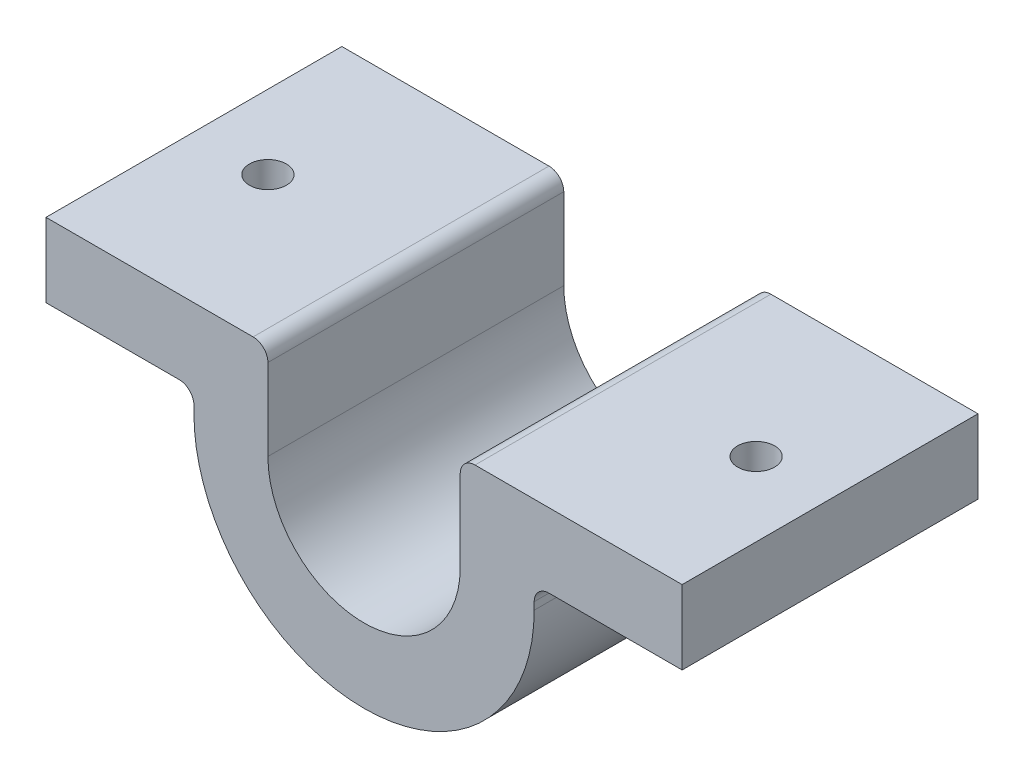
ISO-10303-21;
HEADER;
FILE_DESCRIPTION(('STEP AP214'),'2;1');
FILE_NAME('part.step','',(''),(''),'','','');
FILE_SCHEMA(('AUTOMOTIVE_DESIGN { 1 0 10303 214 1 1 1 1 }'));
ENDSEC;
DATA;
#1=APPLICATION_CONTEXT('core data for automotive mechanical design processes');
#2=APPLICATION_PROTOCOL_DEFINITION('international standard','automotive_design',2000,#1);
#3=PRODUCT_CONTEXT('',#1,'mechanical');
#4=PRODUCT('Part','Part','',(#3));
#5=PRODUCT_RELATED_PRODUCT_CATEGORY('part','',(#4));
#6=PRODUCT_DEFINITION_FORMATION('','',#4);
#7=PRODUCT_DEFINITION_CONTEXT('part definition',#1,'design');
#8=PRODUCT_DEFINITION('design','',#6,#7);
#9=PRODUCT_DEFINITION_SHAPE('','',#8);
#10=(LENGTH_UNIT() NAMED_UNIT(*) SI_UNIT(.MILLI.,.METRE.));
#11=(NAMED_UNIT(*) PLANE_ANGLE_UNIT() SI_UNIT($,.RADIAN.));
#12=(NAMED_UNIT(*) SI_UNIT($,.STERADIAN.) SOLID_ANGLE_UNIT());
#13=UNCERTAINTY_MEASURE_WITH_UNIT(LENGTH_MEASURE(1.E-05),#10,'distance_accuracy_value','');
#14=(GEOMETRIC_REPRESENTATION_CONTEXT(3) GLOBAL_UNCERTAINTY_ASSIGNED_CONTEXT((#13)) GLOBAL_UNIT_ASSIGNED_CONTEXT((#10,
#11,#12)) REPRESENTATION_CONTEXT('',''));
#15=CARTESIAN_POINT('',(0.,0.,0.));
#16=DIRECTION('',(0.,0.,1.));
#17=DIRECTION('',(1.,0.,0.));
#18=AXIS2_PLACEMENT_3D('',#15,#16,#17);
#19=CARTESIAN_POINT('',(-11.5,0.,-20.));
#20=DIRECTION('',(1.,0.,0.));
#21=DIRECTION('',(0.,0.,-1.));
#22=AXIS2_PLACEMENT_3D('',#19,#20,#21);
#23=PLANE('',#22);
#24=DIRECTION('',(0.,1.,0.));
#25=VECTOR('',#24,1.);
#26=CARTESIAN_POINT('',(-11.5,0.,0.));
#27=LINE('',#26,#25);
#28=CARTESIAN_POINT('',(-11.5,0.,0.));
#29=VERTEX_POINT('',#28);
#30=CARTESIAN_POINT('',(-11.5,0.499999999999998,0.));
#31=VERTEX_POINT('',#30);
#32=EDGE_CURVE('E196',#29,#31,#27,.T.);
#33=ORIENTED_EDGE('',*,*,#32,.T.);
#34=DIRECTION('',(0.,0.,1.));
#35=VECTOR('',#34,1.);
#36=CARTESIAN_POINT('',(-11.5,0.499999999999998,-20.));
#37=LINE('',#36,#35);
#38=CARTESIAN_POINT('',(-11.5,0.499999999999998,-20.));
#39=VERTEX_POINT('',#38);
#40=EDGE_CURVE('E165',#31,#39,#37,.F.);
#41=ORIENTED_EDGE('',*,*,#40,.T.);
#42=DIRECTION('',(0.,1.,0.));
#43=VECTOR('',#42,1.);
#44=CARTESIAN_POINT('',(-11.5,0.,-20.));
#45=LINE('',#44,#43);
#46=CARTESIAN_POINT('',(-11.5,0.,-20.));
#47=VERTEX_POINT('',#46);
#48=EDGE_CURVE('E163',#47,#39,#45,.T.);
#49=ORIENTED_EDGE('',*,*,#48,.F.);
#50=DIRECTION('',(0.,0.,1.));
#51=VECTOR('',#50,1.);
#52=CARTESIAN_POINT('',(-11.5,0.,-20.));
#53=LINE('',#52,#51);
#54=EDGE_CURVE('E149',#47,#29,#53,.T.);
#55=ORIENTED_EDGE('',*,*,#54,.T.);
#56=EDGE_LOOP('',(#33,#41,#49,#55));
#57=FACE_BOUND('',#56,.T.);
#58=ADVANCED_FACE('F35',(#57),#23,.F.);
#59=CARTESIAN_POINT('',(0.,1.5,-20.));
#60=DIRECTION('',(0.,1.,0.));
#61=DIRECTION('',(-1.,0.,0.));
#62=AXIS2_PLACEMENT_3D('',#59,#60,#61);
#63=PLANE('',#62);
#64=CARTESIAN_POINT('',(-16.5,1.5,-10.));
#65=DIRECTION('',(0.,-1.,0.));
#66=DIRECTION('',(1.,0.,0.));
#67=AXIS2_PLACEMENT_3D('',#64,#65,#66);
#68=CIRCLE('',#67,1.25);
#69=CARTESIAN_POINT('',(-15.25,1.5,-10.));
#70=VERTEX_POINT('',#69);
#71=EDGE_CURVE('E503',#70,#70,#68,.T.);
#72=ORIENTED_EDGE('',*,*,#71,.F.);
#73=EDGE_LOOP('',(#72));
#74=FACE_BOUND('',#73,.T.);
#75=DIRECTION('',(-1.,0.,0.));
#76=VECTOR('',#75,1.);
#77=CARTESIAN_POINT('',(0.,1.5,-20.));
#78=LINE('',#77,#76);
#79=CARTESIAN_POINT('',(-12.5,1.5,-20.));
#80=VERTEX_POINT('',#79);
#81=CARTESIAN_POINT('',(-21.5,1.5,-20.));
#82=VERTEX_POINT('',#81);
#83=EDGE_CURVE('E160',#80,#82,#78,.T.);
#84=ORIENTED_EDGE('',*,*,#83,.F.);
#85=DIRECTION('',(0.,0.,1.));
#86=VECTOR('',#85,1.);
#87=CARTESIAN_POINT('',(-12.5,1.5,0.));
#88=LINE('',#87,#86);
#89=CARTESIAN_POINT('',(-12.5,1.5,0.));
#90=VERTEX_POINT('',#89);
#91=EDGE_CURVE('E267',#80,#90,#88,.T.);
#92=ORIENTED_EDGE('',*,*,#91,.T.);
#93=DIRECTION('',(-1.,0.,0.));
#94=VECTOR('',#93,1.);
#95=CARTESIAN_POINT('',(0.,1.5,0.));
#96=LINE('',#95,#94);
#97=CARTESIAN_POINT('',(-21.5,1.5,0.));
#98=VERTEX_POINT('',#97);
#99=EDGE_CURVE('E167',#90,#98,#96,.T.);
#100=ORIENTED_EDGE('',*,*,#99,.T.);
#101=DIRECTION('',(0.,0.,1.));
#102=VECTOR('',#101,1.);
#103=CARTESIAN_POINT('',(-21.5,1.5,-20.));
#104=LINE('',#103,#102);
#105=EDGE_CURVE('E224',#82,#98,#104,.T.);
#106=ORIENTED_EDGE('',*,*,#105,.F.);
#107=EDGE_LOOP('',(#84,#92,#100,#106));
#108=FACE_BOUND('',#107,.T.);
#109=ADVANCED_FACE('F283',(#74,#108),#63,.F.);
#110=CARTESIAN_POINT('',(-21.5,0.,-20.));
#111=DIRECTION('',(-1.,0.,0.));
#112=DIRECTION('',(0.,0.,1.));
#113=AXIS2_PLACEMENT_3D('',#110,#111,#112);
#114=PLANE('',#113);
#115=DIRECTION('',(0.,-1.,0.));
#116=VECTOR('',#115,1.);
#117=CARTESIAN_POINT('',(-21.5,0.,0.));
#118=LINE('',#117,#116);
#119=CARTESIAN_POINT('',(-21.5,6.5,0.));
#120=VERTEX_POINT('',#119);
#121=EDGE_CURVE('E220',#120,#98,#118,.T.);
#122=ORIENTED_EDGE('',*,*,#121,.F.);
#123=DIRECTION('',(0.,0.,1.));
#124=VECTOR('',#123,1.);
#125=CARTESIAN_POINT('',(-21.5,6.5,-20.));
#126=LINE('',#125,#124);
#127=CARTESIAN_POINT('',(-21.5,6.5,-20.));
#128=VERTEX_POINT('',#127);
#129=EDGE_CURVE('E228',#128,#120,#126,.T.);
#130=ORIENTED_EDGE('',*,*,#129,.F.);
#131=DIRECTION('',(0.,-1.,0.));
#132=VECTOR('',#131,1.);
#133=CARTESIAN_POINT('',(-21.5,0.,-20.));
#134=LINE('',#133,#132);
#135=EDGE_CURVE('E192',#128,#82,#134,.T.);
#136=ORIENTED_EDGE('',*,*,#135,.T.);
#137=ORIENTED_EDGE('',*,*,#105,.T.);
#138=EDGE_LOOP('',(#122,#130,#136,#137));
#139=FACE_BOUND('',#138,.T.);
#140=ADVANCED_FACE('F287',(#139),#114,.T.);
#141=CARTESIAN_POINT('',(0.,6.5,-20.));
#142=DIRECTION('',(0.,1.,0.));
#143=DIRECTION('',(-1.,0.,0.));
#144=AXIS2_PLACEMENT_3D('',#141,#142,#143);
#145=PLANE('',#144);
#146=CARTESIAN_POINT('',(-16.5,6.5,-10.));
#147=DIRECTION('',(0.,1.,0.));
#148=DIRECTION('',(-1.,0.,0.));
#149=AXIS2_PLACEMENT_3D('',#146,#147,#148);
#150=CIRCLE('',#149,1.25);
#151=CARTESIAN_POINT('',(-17.75,6.5,-10.));
#152=VERTEX_POINT('',#151);
#153=EDGE_CURVE('E198',#152,#152,#150,.T.);
#154=ORIENTED_EDGE('',*,*,#153,.F.);
#155=EDGE_LOOP('',(#154));
#156=FACE_BOUND('',#155,.T.);
#157=DIRECTION('',(-1.,0.,0.));
#158=VECTOR('',#157,1.);
#159=CARTESIAN_POINT('',(0.,6.5,0.));
#160=LINE('',#159,#158);
#161=CARTESIAN_POINT('',(-7.5,6.5,0.));
#162=VERTEX_POINT('',#161);
#163=EDGE_CURVE('E218',#162,#120,#160,.T.);
#164=ORIENTED_EDGE('',*,*,#163,.F.);
#165=DIRECTION('',(0.,0.,1.));
#166=VECTOR('',#165,1.);
#167=CARTESIAN_POINT('',(-7.5,6.5,-20.));
#168=LINE('',#167,#166);
#169=CARTESIAN_POINT('',(-7.5,6.5,-20.));
#170=VERTEX_POINT('',#169);
#171=EDGE_CURVE('E265',#162,#170,#168,.F.);
#172=ORIENTED_EDGE('',*,*,#171,.T.);
#173=DIRECTION('',(-1.,0.,0.));
#174=VECTOR('',#173,1.);
#175=CARTESIAN_POINT('',(0.,6.5,-20.));
#176=LINE('',#175,#174);
#177=EDGE_CURVE('E190',#170,#128,#176,.T.);
#178=ORIENTED_EDGE('',*,*,#177,.T.);
#179=ORIENTED_EDGE('',*,*,#129,.T.);
#180=EDGE_LOOP('',(#164,#172,#178,#179));
#181=FACE_BOUND('',#180,.T.);
#182=ADVANCED_FACE('F437',(#156,#181),#145,.T.);
#183=CARTESIAN_POINT('',(-6.5,0.,-20.));
#184=DIRECTION('',(1.,0.,0.));
#185=DIRECTION('',(0.,0.,-1.));
#186=AXIS2_PLACEMENT_3D('',#183,#184,#185);
#187=PLANE('',#186);
#188=DIRECTION('',(0.,1.,0.));
#189=VECTOR('',#188,1.);
#190=CARTESIAN_POINT('',(-6.5,0.,-20.));
#191=LINE('',#190,#189);
#192=CARTESIAN_POINT('',(-6.5,0.,-20.));
#193=VERTEX_POINT('',#192);
#194=CARTESIAN_POINT('',(-6.5,5.5,-20.));
#195=VERTEX_POINT('',#194);
#196=EDGE_CURVE('E187',#193,#195,#191,.T.);
#197=ORIENTED_EDGE('',*,*,#196,.T.);
#198=DIRECTION('',(0.,0.,1.));
#199=VECTOR('',#198,1.);
#200=CARTESIAN_POINT('',(-6.5,5.5,-20.));
#201=LINE('',#200,#199);
#202=CARTESIAN_POINT('',(-6.5,5.5,0.));
#203=VERTEX_POINT('',#202);
#204=EDGE_CURVE('E262',#195,#203,#201,.T.);
#205=ORIENTED_EDGE('',*,*,#204,.T.);
#206=DIRECTION('',(0.,1.,0.));
#207=VECTOR('',#206,1.);
#208=CARTESIAN_POINT('',(-6.5,0.,0.));
#209=LINE('',#208,#207);
#210=CARTESIAN_POINT('',(-6.5,0.,0.));
#211=VERTEX_POINT('',#210);
#212=EDGE_CURVE('E215',#211,#203,#209,.T.);
#213=ORIENTED_EDGE('',*,*,#212,.F.);
#214=DIRECTION('',(0.,0.,1.));
#215=VECTOR('',#214,1.);
#216=CARTESIAN_POINT('',(-6.5,0.,-20.));
#217=LINE('',#216,#215);
#218=EDGE_CURVE('E231',#193,#211,#217,.T.);
#219=ORIENTED_EDGE('',*,*,#218,.F.);
#220=EDGE_LOOP('',(#197,#205,#213,#219));
#221=FACE_BOUND('',#220,.T.);
#222=ADVANCED_FACE('F298',(#221),#187,.T.);
#223=CARTESIAN_POINT('',(0.,0.,-20.));
#224=DIRECTION('',(0.,0.,1.));
#225=DIRECTION('',(1.,0.,0.));
#226=AXIS2_PLACEMENT_3D('',#223,#224,#225);
#227=CYLINDRICAL_SURFACE('',#226,6.5);
#228=CARTESIAN_POINT('',(0.,0.,0.));
#229=DIRECTION('',(0.,0.,1.));
#230=DIRECTION('',(1.,0.,0.));
#231=AXIS2_PLACEMENT_3D('',#228,#229,#230);
#232=CIRCLE('',#231,6.5);
#233=CARTESIAN_POINT('',(6.5,0.,0.));
#234=VERTEX_POINT('',#233);
#235=EDGE_CURVE('E213',#211,#234,#232,.T.);
#236=ORIENTED_EDGE('',*,*,#235,.T.);
#237=DIRECTION('',(0.,0.,1.));
#238=VECTOR('',#237,1.);
#239=CARTESIAN_POINT('',(6.5,0.,-20.));
#240=LINE('',#239,#238);
#241=CARTESIAN_POINT('',(6.5,0.,-20.));
#242=VERTEX_POINT('',#241);
#243=EDGE_CURVE('E233',#242,#234,#240,.T.);
#244=ORIENTED_EDGE('',*,*,#243,.F.);
#245=CARTESIAN_POINT('',(0.,0.,-20.));
#246=DIRECTION('',(0.,0.,1.));
#247=DIRECTION('',(1.,0.,0.));
#248=AXIS2_PLACEMENT_3D('',#245,#246,#247);
#249=CIRCLE('',#248,6.5);
#250=EDGE_CURVE('E185',#193,#242,#249,.T.);
#251=ORIENTED_EDGE('',*,*,#250,.F.);
#252=ORIENTED_EDGE('',*,*,#218,.T.);
#253=EDGE_LOOP('',(#236,#244,#251,#252));
#254=FACE_BOUND('',#253,.T.);
#255=ADVANCED_FACE('F304',(#254),#227,.F.);
#256=CARTESIAN_POINT('',(6.5,0.,-20.));
#257=DIRECTION('',(1.,0.,0.));
#258=DIRECTION('',(0.,0.,-1.));
#259=AXIS2_PLACEMENT_3D('',#256,#257,#258);
#260=PLANE('',#259);
#261=DIRECTION('',(0.,1.,0.));
#262=VECTOR('',#261,1.);
#263=CARTESIAN_POINT('',(6.5,0.,0.));
#264=LINE('',#263,#262);
#265=CARTESIAN_POINT('',(6.5,5.5,0.));
#266=VERTEX_POINT('',#265);
#267=EDGE_CURVE('E210',#234,#266,#264,.T.);
#268=ORIENTED_EDGE('',*,*,#267,.T.);
#269=DIRECTION('',(0.,0.,1.));
#270=VECTOR('',#269,1.);
#271=CARTESIAN_POINT('',(6.5,5.5,-20.));
#272=LINE('',#271,#270);
#273=CARTESIAN_POINT('',(6.5,5.5,-20.));
#274=VERTEX_POINT('',#273);
#275=EDGE_CURVE('E252',#266,#274,#272,.F.);
#276=ORIENTED_EDGE('',*,*,#275,.T.);
#277=DIRECTION('',(0.,1.,0.));
#278=VECTOR('',#277,1.);
#279=CARTESIAN_POINT('',(6.5,0.,-20.));
#280=LINE('',#279,#278);
#281=EDGE_CURVE('E183',#242,#274,#280,.T.);
#282=ORIENTED_EDGE('',*,*,#281,.F.);
#283=ORIENTED_EDGE('',*,*,#243,.T.);
#284=EDGE_LOOP('',(#268,#276,#282,#283));
#285=FACE_BOUND('',#284,.T.);
#286=ADVANCED_FACE('F308',(#285),#260,.F.);
#287=CARTESIAN_POINT('',(0.,6.5,-20.));
#288=DIRECTION('',(0.,-1.,0.));
#289=DIRECTION('',(0.,0.,-1.));
#290=AXIS2_PLACEMENT_3D('',#287,#288,#289);
#291=PLANE('',#290);
#292=CARTESIAN_POINT('',(16.5,6.5,-10.));
#293=DIRECTION('',(0.,-1.,0.));
#294=DIRECTION('',(0.,0.,-1.));
#295=AXIS2_PLACEMENT_3D('',#292,#293,#294);
#296=CIRCLE('',#295,1.25);
#297=CARTESIAN_POINT('',(16.5,6.5,-11.25));
#298=VERTEX_POINT('',#297);
#299=EDGE_CURVE('E245',#298,#298,#296,.T.);
#300=ORIENTED_EDGE('',*,*,#299,.T.);
#301=EDGE_LOOP('',(#300));
#302=FACE_BOUND('',#301,.T.);
#303=DIRECTION('',(1.,0.,0.));
#304=VECTOR('',#303,1.);
#305=CARTESIAN_POINT('',(0.,6.5,-20.));
#306=LINE('',#305,#304);
#307=CARTESIAN_POINT('',(7.5,6.5,-20.));
#308=VERTEX_POINT('',#307);
#309=CARTESIAN_POINT('',(21.5,6.5,-20.));
#310=VERTEX_POINT('',#309);
#311=EDGE_CURVE('E181',#308,#310,#306,.T.);
#312=ORIENTED_EDGE('',*,*,#311,.F.);
#313=DIRECTION('',(0.,0.,1.));
#314=VECTOR('',#313,1.);
#315=CARTESIAN_POINT('',(7.5,6.5,-20.));
#316=LINE('',#315,#314);
#317=CARTESIAN_POINT('',(7.5,6.5,0.));
#318=VERTEX_POINT('',#317);
#319=EDGE_CURVE('E227',#308,#318,#316,.T.);
#320=ORIENTED_EDGE('',*,*,#319,.T.);
#321=DIRECTION('',(1.,0.,0.));
#322=VECTOR('',#321,1.);
#323=CARTESIAN_POINT('',(0.,6.5,0.));
#324=LINE('',#323,#322);
#325=CARTESIAN_POINT('',(21.5,6.5,0.));
#326=VERTEX_POINT('',#325);
#327=EDGE_CURVE('E208',#318,#326,#324,.T.);
#328=ORIENTED_EDGE('',*,*,#327,.T.);
#329=DIRECTION('',(0.,0.,1.));
#330=VECTOR('',#329,1.);
#331=CARTESIAN_POINT('',(21.5,6.5,-20.));
#332=LINE('',#331,#330);
#333=EDGE_CURVE('E236',#310,#326,#332,.T.);
#334=ORIENTED_EDGE('',*,*,#333,.F.);
#335=EDGE_LOOP('',(#312,#320,#328,#334));
#336=FACE_BOUND('',#335,.T.);
#337=ADVANCED_FACE('F316',(#302,#336),#291,.F.);
#338=CARTESIAN_POINT('',(21.5,0.,-20.));
#339=DIRECTION('',(-1.,0.,0.));
#340=DIRECTION('',(0.,0.,1.));
#341=AXIS2_PLACEMENT_3D('',#338,#339,#340);
#342=PLANE('',#341);
#343=DIRECTION('',(0.,-1.,0.));
#344=VECTOR('',#343,1.);
#345=CARTESIAN_POINT('',(21.5,0.,0.));
#346=LINE('',#345,#344);
#347=CARTESIAN_POINT('',(21.5,1.5,0.));
#348=VERTEX_POINT('',#347);
#349=EDGE_CURVE('E205',#326,#348,#346,.T.);
#350=ORIENTED_EDGE('',*,*,#349,.T.);
#351=DIRECTION('',(0.,0.,1.));
#352=VECTOR('',#351,1.);
#353=CARTESIAN_POINT('',(21.5,1.5,-20.));
#354=LINE('',#353,#352);
#355=CARTESIAN_POINT('',(21.5,1.5,-20.));
#356=VERTEX_POINT('',#355);
#357=EDGE_CURVE('E239',#356,#348,#354,.T.);
#358=ORIENTED_EDGE('',*,*,#357,.F.);
#359=DIRECTION('',(0.,-1.,0.));
#360=VECTOR('',#359,1.);
#361=CARTESIAN_POINT('',(21.5,0.,-20.));
#362=LINE('',#361,#360);
#363=EDGE_CURVE('E178',#310,#356,#362,.T.);
#364=ORIENTED_EDGE('',*,*,#363,.F.);
#365=ORIENTED_EDGE('',*,*,#333,.T.);
#366=EDGE_LOOP('',(#350,#358,#364,#365));
#367=FACE_BOUND('',#366,.T.);
#368=ADVANCED_FACE('F321',(#367),#342,.F.);
#369=CARTESIAN_POINT('',(0.,1.5,-20.));
#370=DIRECTION('',(0.,-1.,0.));
#371=DIRECTION('',(0.,0.,-1.));
#372=AXIS2_PLACEMENT_3D('',#369,#370,#371);
#373=PLANE('',#372);
#374=CARTESIAN_POINT('',(16.5,1.5,-10.));
#375=DIRECTION('',(0.,-1.,0.));
#376=DIRECTION('',(1.,0.,0.));
#377=AXIS2_PLACEMENT_3D('',#374,#375,#376);
#378=CIRCLE('',#377,1.25);
#379=CARTESIAN_POINT('',(17.75,1.5,-10.));
#380=VERTEX_POINT('',#379);
#381=EDGE_CURVE('E500',#380,#380,#378,.T.);
#382=ORIENTED_EDGE('',*,*,#381,.F.);
#383=EDGE_LOOP('',(#382));
#384=FACE_BOUND('',#383,.T.);
#385=DIRECTION('',(1.,0.,0.));
#386=VECTOR('',#385,1.);
#387=CARTESIAN_POINT('',(0.,1.5,0.));
#388=LINE('',#387,#386);
#389=CARTESIAN_POINT('',(12.5,1.5,0.));
#390=VERTEX_POINT('',#389);
#391=EDGE_CURVE('E203',#390,#348,#388,.T.);
#392=ORIENTED_EDGE('',*,*,#391,.F.);
#393=DIRECTION('',(0.,0.,1.));
#394=VECTOR('',#393,1.);
#395=CARTESIAN_POINT('',(12.5,1.5,-20.));
#396=LINE('',#395,#394);
#397=CARTESIAN_POINT('',(12.5,1.5,-20.));
#398=VERTEX_POINT('',#397);
#399=EDGE_CURVE('E58',#390,#398,#396,.F.);
#400=ORIENTED_EDGE('',*,*,#399,.T.);
#401=DIRECTION('',(1.,0.,0.));
#402=VECTOR('',#401,1.);
#403=CARTESIAN_POINT('',(0.,1.5,-20.));
#404=LINE('',#403,#402);
#405=EDGE_CURVE('E173',#398,#356,#404,.T.);
#406=ORIENTED_EDGE('',*,*,#405,.T.);
#407=ORIENTED_EDGE('',*,*,#357,.T.);
#408=EDGE_LOOP('',(#392,#400,#406,#407));
#409=FACE_BOUND('',#408,.T.);
#410=ADVANCED_FACE('F329',(#384,#409),#373,.T.);
#411=CARTESIAN_POINT('',(11.5,0.,-20.));
#412=DIRECTION('',(1.,0.,0.));
#413=DIRECTION('',(0.,0.,-1.));
#414=AXIS2_PLACEMENT_3D('',#411,#412,#413);
#415=PLANE('',#414);
#416=DIRECTION('',(0.,1.,0.));
#417=VECTOR('',#416,1.);
#418=CARTESIAN_POINT('',(11.5,0.,-20.));
#419=LINE('',#418,#417);
#420=CARTESIAN_POINT('',(11.5,0.,-20.));
#421=VERTEX_POINT('',#420);
#422=CARTESIAN_POINT('',(11.5,0.499999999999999,-20.));
#423=VERTEX_POINT('',#422);
#424=EDGE_CURVE('E171',#421,#423,#419,.T.);
#425=ORIENTED_EDGE('',*,*,#424,.T.);
#426=DIRECTION('',(0.,0.,1.));
#427=VECTOR('',#426,1.);
#428=CARTESIAN_POINT('',(11.5,0.499999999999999,0.));
#429=LINE('',#428,#427);
#430=CARTESIAN_POINT('',(11.5,0.499999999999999,0.));
#431=VERTEX_POINT('',#430);
#432=EDGE_CURVE('E258',#423,#431,#429,.T.);
#433=ORIENTED_EDGE('',*,*,#432,.T.);
#434=DIRECTION('',(0.,1.,0.));
#435=VECTOR('',#434,1.);
#436=CARTESIAN_POINT('',(11.5,0.,0.));
#437=LINE('',#436,#435);
#438=CARTESIAN_POINT('',(11.5,0.,0.));
#439=VERTEX_POINT('',#438);
#440=EDGE_CURVE('E200',#439,#431,#437,.T.);
#441=ORIENTED_EDGE('',*,*,#440,.F.);
#442=DIRECTION('',(0.,0.,1.));
#443=VECTOR('',#442,1.);
#444=CARTESIAN_POINT('',(11.5,0.,-20.));
#445=LINE('',#444,#443);
#446=EDGE_CURVE('E159',#421,#439,#445,.T.);
#447=ORIENTED_EDGE('',*,*,#446,.F.);
#448=EDGE_LOOP('',(#425,#433,#441,#447));
#449=FACE_BOUND('',#448,.T.);
#450=ADVANCED_FACE('F328',(#449),#415,.T.);
#451=CARTESIAN_POINT('',(0.,0.,-20.));
#452=DIRECTION('',(0.,0.,1.));
#453=DIRECTION('',(1.,0.,0.));
#454=AXIS2_PLACEMENT_3D('',#451,#452,#453);
#455=CYLINDRICAL_SURFACE('',#454,11.5);
#456=CARTESIAN_POINT('',(0.,0.,0.));
#457=DIRECTION('',(0.,0.,1.));
#458=DIRECTION('',(1.,0.,0.));
#459=AXIS2_PLACEMENT_3D('',#456,#457,#458);
#460=CIRCLE('',#459,11.5);
#461=EDGE_CURVE('E155',#29,#439,#460,.T.);
#462=ORIENTED_EDGE('',*,*,#461,.F.);
#463=ORIENTED_EDGE('',*,*,#54,.F.);
#464=CARTESIAN_POINT('',(0.,0.,-20.));
#465=DIRECTION('',(0.,0.,1.));
#466=DIRECTION('',(1.,0.,0.));
#467=AXIS2_PLACEMENT_3D('',#464,#465,#466);
#468=CIRCLE('',#467,11.5);
#469=EDGE_CURVE('E153',#47,#421,#468,.T.);
#470=ORIENTED_EDGE('',*,*,#469,.T.);
#471=ORIENTED_EDGE('',*,*,#446,.T.);
#472=EDGE_LOOP('',(#462,#463,#470,#471));
#473=FACE_BOUND('',#472,.T.);
#474=ADVANCED_FACE('F151',(#473),#455,.T.);
#475=CARTESIAN_POINT('',(0.,0.,-20.));
#476=DIRECTION('',(0.,0.,1.));
#477=DIRECTION('',(1.,0.,0.));
#478=AXIS2_PLACEMENT_3D('',#475,#476,#477);
#479=PLANE('',#478);
#480=ORIENTED_EDGE('',*,*,#281,.T.);
#481=CARTESIAN_POINT('',(7.5,5.5,-20.));
#482=DIRECTION('',(0.,0.,1.));
#483=DIRECTION('',(1.,0.,0.));
#484=AXIS2_PLACEMENT_3D('',#481,#482,#483);
#485=CIRCLE('',#484,1.);
#486=EDGE_CURVE('E256',#274,#308,#485,.F.);
#487=ORIENTED_EDGE('',*,*,#486,.T.);
#488=ORIENTED_EDGE('',*,*,#311,.T.);
#489=ORIENTED_EDGE('',*,*,#363,.T.);
#490=ORIENTED_EDGE('',*,*,#405,.F.);
#491=CARTESIAN_POINT('',(12.5,0.499999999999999,-20.));
#492=DIRECTION('',(0.,0.,1.));
#493=DIRECTION('',(1.,0.,0.));
#494=AXIS2_PLACEMENT_3D('',#491,#492,#493);
#495=CIRCLE('',#494,1.);
#496=EDGE_CURVE('E50',#398,#423,#495,.T.);
#497=ORIENTED_EDGE('',*,*,#496,.T.);
#498=ORIENTED_EDGE('',*,*,#424,.F.);
#499=ORIENTED_EDGE('',*,*,#469,.F.);
#500=ORIENTED_EDGE('',*,*,#48,.T.);
#501=CARTESIAN_POINT('',(-12.5,0.499999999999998,-20.));
#502=DIRECTION('',(0.,0.,1.));
#503=DIRECTION('',(1.,0.,0.));
#504=AXIS2_PLACEMENT_3D('',#501,#502,#503);
#505=CIRCLE('',#504,1.);
#506=EDGE_CURVE('E11',#39,#80,#505,.T.);
#507=ORIENTED_EDGE('',*,*,#506,.T.);
#508=ORIENTED_EDGE('',*,*,#83,.T.);
#509=ORIENTED_EDGE('',*,*,#135,.F.);
#510=ORIENTED_EDGE('',*,*,#177,.F.);
#511=CARTESIAN_POINT('',(-7.5,5.5,-20.));
#512=DIRECTION('',(0.,0.,1.));
#513=DIRECTION('',(1.,0.,0.));
#514=AXIS2_PLACEMENT_3D('',#511,#512,#513);
#515=CIRCLE('',#514,1.);
#516=EDGE_CURVE('E254',#170,#195,#515,.F.);
#517=ORIENTED_EDGE('',*,*,#516,.T.);
#518=ORIENTED_EDGE('',*,*,#196,.F.);
#519=ORIENTED_EDGE('',*,*,#250,.T.);
#520=EDGE_LOOP('',(#480,#487,#488,#489,#490,#497,#498,#499,#500,#507,#508,#509,#510,#517,#518,#519));
#521=FACE_BOUND('',#520,.T.);
#522=ADVANCED_FACE('F170',(#521),#479,.F.);
#523=CARTESIAN_POINT('',(0.,0.,0.));
#524=DIRECTION('',(0.,0.,1.));
#525=DIRECTION('',(1.,0.,0.));
#526=AXIS2_PLACEMENT_3D('',#523,#524,#525);
#527=PLANE('',#526);
#528=ORIENTED_EDGE('',*,*,#327,.F.);
#529=CARTESIAN_POINT('',(7.5,5.5,0.));
#530=DIRECTION('',(0.,0.,1.));
#531=DIRECTION('',(1.,0.,0.));
#532=AXIS2_PLACEMENT_3D('',#529,#530,#531);
#533=CIRCLE('',#532,1.);
#534=EDGE_CURVE('E250',#318,#266,#533,.T.);
#535=ORIENTED_EDGE('',*,*,#534,.T.);
#536=ORIENTED_EDGE('',*,*,#267,.F.);
#537=ORIENTED_EDGE('',*,*,#235,.F.);
#538=ORIENTED_EDGE('',*,*,#212,.T.);
#539=CARTESIAN_POINT('',(-7.5,5.5,0.));
#540=DIRECTION('',(0.,0.,1.));
#541=DIRECTION('',(1.,0.,0.));
#542=AXIS2_PLACEMENT_3D('',#539,#540,#541);
#543=CIRCLE('',#542,1.);
#544=EDGE_CURVE('E248',#203,#162,#543,.T.);
#545=ORIENTED_EDGE('',*,*,#544,.T.);
#546=ORIENTED_EDGE('',*,*,#163,.T.);
#547=ORIENTED_EDGE('',*,*,#121,.T.);
#548=ORIENTED_EDGE('',*,*,#99,.F.);
#549=CARTESIAN_POINT('',(-12.5,0.499999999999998,0.));
#550=DIRECTION('',(0.,0.,1.));
#551=DIRECTION('',(1.,0.,0.));
#552=AXIS2_PLACEMENT_3D('',#549,#550,#551);
#553=CIRCLE('',#552,1.);
#554=EDGE_CURVE('E43',#90,#31,#553,.F.);
#555=ORIENTED_EDGE('',*,*,#554,.T.);
#556=ORIENTED_EDGE('',*,*,#32,.F.);
#557=ORIENTED_EDGE('',*,*,#461,.T.);
#558=ORIENTED_EDGE('',*,*,#440,.T.);
#559=CARTESIAN_POINT('',(12.5,0.499999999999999,0.));
#560=DIRECTION('',(0.,0.,1.));
#561=DIRECTION('',(1.,0.,0.));
#562=AXIS2_PLACEMENT_3D('',#559,#560,#561);
#563=CIRCLE('',#562,1.);
#564=EDGE_CURVE('E271',#431,#390,#563,.F.);
#565=ORIENTED_EDGE('',*,*,#564,.T.);
#566=ORIENTED_EDGE('',*,*,#391,.T.);
#567=ORIENTED_EDGE('',*,*,#349,.F.);
#568=EDGE_LOOP('',(#528,#535,#536,#537,#538,#545,#546,#547,#548,#555,#556,#557,#558,#565,#566,#567));
#569=FACE_BOUND('',#568,.T.);
#570=ADVANCED_FACE('F276',(#569),#527,.T.);
#571=CARTESIAN_POINT('',(16.5,21.5,-10.));
#572=DIRECTION('',(0.,-1.,0.));
#573=DIRECTION('',(1.,0.,0.));
#574=AXIS2_PLACEMENT_3D('',#571,#572,#573);
#575=CYLINDRICAL_SURFACE('',#574,1.25);
#576=ORIENTED_EDGE('',*,*,#381,.T.);
#577=EDGE_LOOP('',(#576));
#578=FACE_BOUND('',#577,.T.);
#579=ORIENTED_EDGE('',*,*,#299,.F.);
#580=EDGE_LOOP('',(#579));
#581=FACE_BOUND('',#580,.T.);
#582=ADVANCED_FACE('F386',(#578,#581),#575,.F.);
#583=CARTESIAN_POINT('',(-16.5,21.5,-10.));
#584=DIRECTION('',(0.,-1.,0.));
#585=DIRECTION('',(1.,0.,0.));
#586=AXIS2_PLACEMENT_3D('',#583,#584,#585);
#587=CYLINDRICAL_SURFACE('',#586,1.25);
#588=ORIENTED_EDGE('',*,*,#153,.T.);
#589=EDGE_LOOP('',(#588));
#590=FACE_BOUND('',#589,.T.);
#591=ORIENTED_EDGE('',*,*,#71,.T.);
#592=EDGE_LOOP('',(#591));
#593=FACE_BOUND('',#592,.T.);
#594=ADVANCED_FACE('F351',(#590,#593),#587,.F.);
#595=CARTESIAN_POINT('',(7.5,5.5,-20.));
#596=DIRECTION('',(0.,0.,1.));
#597=DIRECTION('',(1.,0.,0.));
#598=AXIS2_PLACEMENT_3D('',#595,#596,#597);
#599=CYLINDRICAL_SURFACE('',#598,1.);
#600=ORIENTED_EDGE('',*,*,#486,.F.);
#601=ORIENTED_EDGE('',*,*,#275,.F.);
#602=ORIENTED_EDGE('',*,*,#534,.F.);
#603=ORIENTED_EDGE('',*,*,#319,.F.);
#604=EDGE_LOOP('',(#600,#601,#602,#603));
#605=FACE_BOUND('',#604,.T.);
#606=ADVANCED_FACE('F314',(#605),#599,.T.);
#607=CARTESIAN_POINT('',(12.5,0.499999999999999,-20.));
#608=DIRECTION('',(0.,0.,-1.));
#609=DIRECTION('',(-1.,0.,0.));
#610=AXIS2_PLACEMENT_3D('',#607,#608,#609);
#611=CYLINDRICAL_SURFACE('',#610,1.);
#612=ORIENTED_EDGE('',*,*,#496,.F.);
#613=ORIENTED_EDGE('',*,*,#399,.F.);
#614=ORIENTED_EDGE('',*,*,#564,.F.);
#615=ORIENTED_EDGE('',*,*,#432,.F.);
#616=EDGE_LOOP('',(#612,#613,#614,#615));
#617=FACE_BOUND('',#616,.T.);
#618=ADVANCED_FACE('F325',(#617),#611,.F.);
#619=CARTESIAN_POINT('',(-7.5,5.5,-20.));
#620=DIRECTION('',(0.,0.,1.));
#621=DIRECTION('',(1.,0.,0.));
#622=AXIS2_PLACEMENT_3D('',#619,#620,#621);
#623=CYLINDRICAL_SURFACE('',#622,1.);
#624=ORIENTED_EDGE('',*,*,#516,.F.);
#625=ORIENTED_EDGE('',*,*,#171,.F.);
#626=ORIENTED_EDGE('',*,*,#544,.F.);
#627=ORIENTED_EDGE('',*,*,#204,.F.);
#628=EDGE_LOOP('',(#624,#625,#626,#627));
#629=FACE_BOUND('',#628,.T.);
#630=ADVANCED_FACE('F295',(#629),#623,.T.);
#631=CARTESIAN_POINT('',(-12.5,0.499999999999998,-20.));
#632=DIRECTION('',(0.,0.,-1.));
#633=DIRECTION('',(-1.,0.,0.));
#634=AXIS2_PLACEMENT_3D('',#631,#632,#633);
#635=CYLINDRICAL_SURFACE('',#634,1.);
#636=ORIENTED_EDGE('',*,*,#506,.F.);
#637=ORIENTED_EDGE('',*,*,#40,.F.);
#638=ORIENTED_EDGE('',*,*,#554,.F.);
#639=ORIENTED_EDGE('',*,*,#91,.F.);
#640=EDGE_LOOP('',(#636,#637,#638,#639));
#641=FACE_BOUND('',#640,.T.);
#642=ADVANCED_FACE('F37',(#641),#635,.F.);
#643=CLOSED_SHELL('',(#58,#109,#140,#182,#222,#255,#286,#337,#368,#410,#450,#474,#522,#570,#582,
#594,#606,#618,#630,#642));
#644=MANIFOLD_SOLID_BREP('B2',#643);
#645=ADVANCED_BREP_SHAPE_REPRESENTATION('',(#18,#644),#14);
#646=SHAPE_DEFINITION_REPRESENTATION(#9,#645);
ENDSEC;
END-ISO-10303-21;
